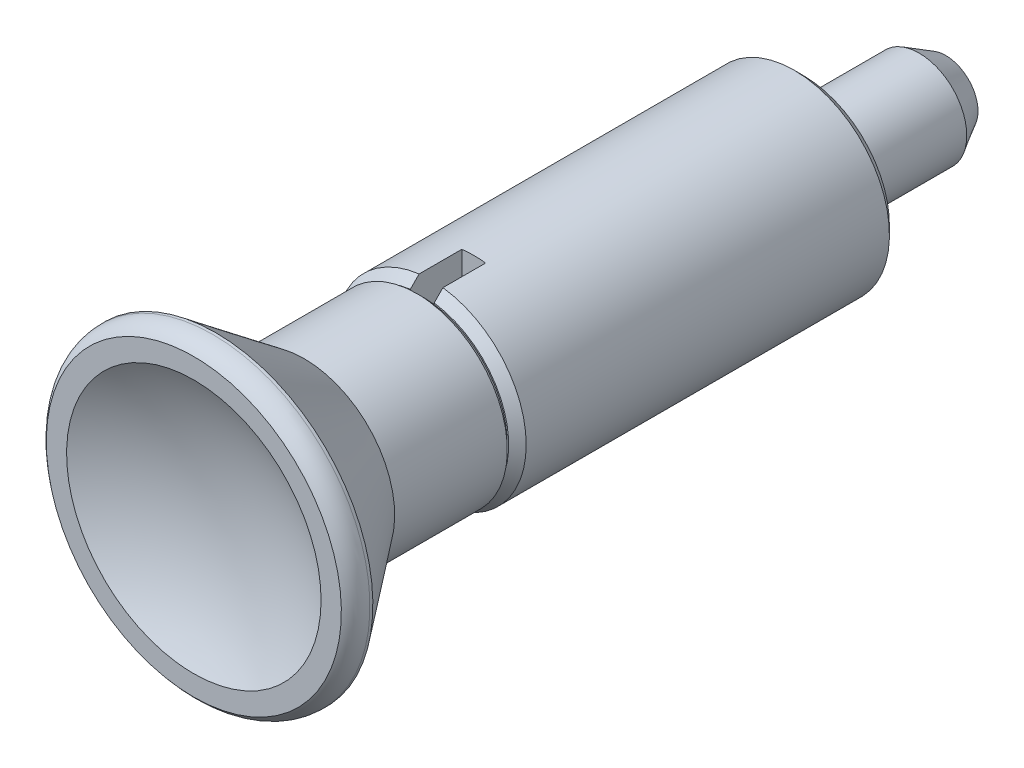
ISO-10303-21;
HEADER;
FILE_DESCRIPTION(('STEP AP214'),'2;1');
FILE_NAME('part.step','',(''),(''),'','','');
FILE_SCHEMA(('AUTOMOTIVE_DESIGN { 1 0 10303 214 1 1 1 1 }'));
ENDSEC;
DATA;
#1=APPLICATION_CONTEXT('core data for automotive mechanical design processes');
#2=APPLICATION_PROTOCOL_DEFINITION('international standard','automotive_design',2000,#1);
#3=PRODUCT_CONTEXT('',#1,'mechanical');
#4=PRODUCT('Part','Part','',(#3));
#5=PRODUCT_RELATED_PRODUCT_CATEGORY('part','',(#4));
#6=PRODUCT_DEFINITION_FORMATION('','',#4);
#7=PRODUCT_DEFINITION_CONTEXT('part definition',#1,'design');
#8=PRODUCT_DEFINITION('design','',#6,#7);
#9=PRODUCT_DEFINITION_SHAPE('','',#8);
#10=(LENGTH_UNIT() NAMED_UNIT(*) SI_UNIT(.MILLI.,.METRE.));
#11=(NAMED_UNIT(*) PLANE_ANGLE_UNIT() SI_UNIT($,.RADIAN.));
#12=(NAMED_UNIT(*) SI_UNIT($,.STERADIAN.) SOLID_ANGLE_UNIT());
#13=UNCERTAINTY_MEASURE_WITH_UNIT(LENGTH_MEASURE(1.E-05),#10,'distance_accuracy_value','');
#14=(GEOMETRIC_REPRESENTATION_CONTEXT(3) GLOBAL_UNCERTAINTY_ASSIGNED_CONTEXT((#13)) GLOBAL_UNIT_ASSIGNED_CONTEXT((#10,
#11,#12)) REPRESENTATION_CONTEXT('',''));
#15=CARTESIAN_POINT('',(0.,0.,0.));
#16=DIRECTION('',(0.,0.,1.));
#17=DIRECTION('',(1.,0.,0.));
#18=AXIS2_PLACEMENT_3D('',#15,#16,#17);
#19=CARTESIAN_POINT('',(1.25,19.,34.6));
#20=DIRECTION('',(0.,0.,1.));
#21=DIRECTION('',(0.,1.,0.));
#22=AXIS2_PLACEMENT_3D('',#19,#20,#21);
#23=PLANE('',#22);
#24=DIRECTION('',(0.,1.,0.));
#25=VECTOR('',#24,1.);
#26=CARTESIAN_POINT('',(-1.25,19.,34.6));
#27=LINE('',#26,#25);
#28=CARTESIAN_POINT('',(-1.25,-9.92156741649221,34.6));
#29=VERTEX_POINT('',#28);
#30=CARTESIAN_POINT('',(-1.25,-4.84122918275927,34.6));
#31=VERTEX_POINT('',#30);
#32=EDGE_CURVE('E152',#29,#31,#27,.T.);
#33=ORIENTED_EDGE('',*,*,#32,.F.);
#34=CARTESIAN_POINT('',(0.,0.,34.6));
#35=DIRECTION('',(0.,0.,1.));
#36=DIRECTION('',(0.,1.,0.));
#37=AXIS2_PLACEMENT_3D('',#34,#35,#36);
#38=CIRCLE('',#37,10.);
#39=CARTESIAN_POINT('',(1.25,-9.92156741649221,34.6));
#40=VERTEX_POINT('',#39);
#41=EDGE_CURVE('E113',#40,#29,#38,.F.);
#42=ORIENTED_EDGE('',*,*,#41,.F.);
#43=DIRECTION('',(0.,-1.,0.));
#44=VECTOR('',#43,1.);
#45=CARTESIAN_POINT('',(1.25,19.,34.6));
#46=LINE('',#45,#44);
#47=CARTESIAN_POINT('',(1.25,-4.84122918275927,34.6));
#48=VERTEX_POINT('',#47);
#49=EDGE_CURVE('E144',#48,#40,#46,.T.);
#50=ORIENTED_EDGE('',*,*,#49,.F.);
#51=CARTESIAN_POINT('',(0.,0.,34.6));
#52=DIRECTION('',(0.,0.,1.));
#53=DIRECTION('',(0.,1.,0.));
#54=AXIS2_PLACEMENT_3D('',#51,#52,#53);
#55=CIRCLE('',#54,5.);
#56=EDGE_CURVE('E139',#31,#48,#55,.T.);
#57=ORIENTED_EDGE('',*,*,#56,.F.);
#58=EDGE_LOOP('',(#33,#42,#50,#57));
#59=FACE_BOUND('',#58,.T.);
#60=ADVANCED_FACE('F14',(#59),#23,.T.);
#61=CARTESIAN_POINT('',(1.25,19.,34.6));
#62=DIRECTION('',(0.,0.,1.));
#63=DIRECTION('',(0.,1.,0.));
#64=AXIS2_PLACEMENT_3D('',#61,#62,#63);
#65=PLANE('',#64);
#66=DIRECTION('',(0.,-1.,0.));
#67=VECTOR('',#66,1.);
#68=CARTESIAN_POINT('',(1.25,19.,34.6));
#69=LINE('',#68,#67);
#70=CARTESIAN_POINT('',(1.25,9.92156741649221,34.6));
#71=VERTEX_POINT('',#70);
#72=CARTESIAN_POINT('',(1.25,4.84122918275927,34.6));
#73=VERTEX_POINT('',#72);
#74=EDGE_CURVE('E109',#71,#73,#69,.T.);
#75=ORIENTED_EDGE('',*,*,#74,.F.);
#76=CARTESIAN_POINT('',(0.,0.,34.6));
#77=DIRECTION('',(0.,0.,1.));
#78=DIRECTION('',(0.,1.,0.));
#79=AXIS2_PLACEMENT_3D('',#76,#77,#78);
#80=CIRCLE('',#79,10.);
#81=CARTESIAN_POINT('',(-1.25,9.92156741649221,34.6));
#82=VERTEX_POINT('',#81);
#83=EDGE_CURVE('E102',#82,#71,#80,.F.);
#84=ORIENTED_EDGE('',*,*,#83,.F.);
#85=DIRECTION('',(0.,1.,0.));
#86=VECTOR('',#85,1.);
#87=CARTESIAN_POINT('',(-1.25,19.,34.6));
#88=LINE('',#87,#86);
#89=CARTESIAN_POINT('',(-1.25,4.84122918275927,34.6));
#90=VERTEX_POINT('',#89);
#91=EDGE_CURVE('E106',#90,#82,#88,.T.);
#92=ORIENTED_EDGE('',*,*,#91,.F.);
#93=CARTESIAN_POINT('',(0.,0.,34.6));
#94=DIRECTION('',(0.,0.,1.));
#95=DIRECTION('',(0.,1.,0.));
#96=AXIS2_PLACEMENT_3D('',#93,#94,#95);
#97=CIRCLE('',#96,5.);
#98=EDGE_CURVE('E279',#73,#90,#97,.T.);
#99=ORIENTED_EDGE('',*,*,#98,.F.);
#100=EDGE_LOOP('',(#75,#84,#92,#99));
#101=FACE_BOUND('',#100,.T.);
#102=ADVANCED_FACE('F104',(#101),#65,.T.);
#103=CARTESIAN_POINT('',(0.,0.,0.));
#104=DIRECTION('',(0.,0.,1.));
#105=DIRECTION('',(0.,1.,0.));
#106=AXIS2_PLACEMENT_3D('',#103,#104,#105);
#107=CYLINDRICAL_SURFACE('',#106,10.);
#108=DIRECTION('',(0.,0.,1.));
#109=VECTOR('',#108,1.);
#110=CARTESIAN_POINT('',(1.25,-9.92156741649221,40.));
#111=LINE('',#110,#109);
#112=CARTESIAN_POINT('',(1.25,-9.92156741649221,39.08));
#113=VERTEX_POINT('',#112);
#114=EDGE_CURVE('E141',#40,#113,#111,.T.);
#115=ORIENTED_EDGE('',*,*,#114,.F.);
#116=ORIENTED_EDGE('',*,*,#41,.T.);
#117=DIRECTION('',(0.,0.,1.));
#118=VECTOR('',#117,1.);
#119=CARTESIAN_POINT('',(-1.25,-9.92156741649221,34.6));
#120=LINE('',#119,#118);
#121=CARTESIAN_POINT('',(-1.25,-9.92156741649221,39.08));
#122=VERTEX_POINT('',#121);
#123=EDGE_CURVE('E148',#122,#29,#120,.F.);
#124=ORIENTED_EDGE('',*,*,#123,.F.);
#125=CARTESIAN_POINT('',(0.,0.,39.08));
#126=DIRECTION('',(0.,0.,-1.));
#127=DIRECTION('',(0.,-1.,0.));
#128=AXIS2_PLACEMENT_3D('',#125,#126,#127);
#129=CIRCLE('',#128,10.);
#130=CARTESIAN_POINT('',(-1.25,9.92156741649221,39.08));
#131=VERTEX_POINT('',#130);
#132=EDGE_CURVE('E122',#131,#122,#129,.F.);
#133=ORIENTED_EDGE('',*,*,#132,.F.);
#134=DIRECTION('',(0.,0.,1.));
#135=VECTOR('',#134,1.);
#136=CARTESIAN_POINT('',(-1.25,9.92156741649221,34.6));
#137=LINE('',#136,#135);
#138=EDGE_CURVE('E117',#82,#131,#137,.T.);
#139=ORIENTED_EDGE('',*,*,#138,.F.);
#140=ORIENTED_EDGE('',*,*,#83,.T.);
#141=DIRECTION('',(0.,0.,1.));
#142=VECTOR('',#141,1.);
#143=CARTESIAN_POINT('',(1.25,9.92156741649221,40.));
#144=LINE('',#143,#142);
#145=CARTESIAN_POINT('',(1.25,9.92156741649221,39.08));
#146=VERTEX_POINT('',#145);
#147=EDGE_CURVE('E284',#146,#71,#144,.F.);
#148=ORIENTED_EDGE('',*,*,#147,.F.);
#149=CARTESIAN_POINT('',(0.,0.,39.08));
#150=DIRECTION('',(0.,0.,-1.));
#151=DIRECTION('',(0.,-1.,0.));
#152=AXIS2_PLACEMENT_3D('',#149,#150,#151);
#153=CIRCLE('',#152,10.);
#154=EDGE_CURVE('E132',#113,#146,#153,.F.);
#155=ORIENTED_EDGE('',*,*,#154,.F.);
#156=EDGE_LOOP('',(#115,#116,#124,#133,#139,#140,#148,#155));
#157=FACE_BOUND('',#156,.T.);
#158=CARTESIAN_POINT('',(0.,0.,0.92));
#159=DIRECTION('',(0.,0.,1.));
#160=DIRECTION('',(0.,1.,0.));
#161=AXIS2_PLACEMENT_3D('',#158,#159,#160);
#162=CIRCLE('',#161,10.);
#163=CARTESIAN_POINT('',(0.,10.,0.92));
#164=VERTEX_POINT('',#163);
#165=EDGE_CURVE('E114',#164,#164,#162,.T.);
#166=ORIENTED_EDGE('',*,*,#165,.T.);
#167=EDGE_LOOP('',(#166));
#168=FACE_BOUND('',#167,.T.);
#169=ADVANCED_FACE('F119',(#157,#168),#107,.T.);
#170=CARTESIAN_POINT('',(0.,0.,39.08));
#171=DIRECTION('',(0.,0.,-1.));
#172=DIRECTION('',(0.,-1.,0.));
#173=AXIS2_PLACEMENT_3D('',#170,#171,#172);
#174=CONICAL_SURFACE('',#173,10.,0.78539816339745);
#175=CARTESIAN_POINT('',(-1.25,9.92156741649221,39.08));
#176=CARTESIAN_POINT('',(-1.25,9.76696218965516,39.2333986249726));
#177=CARTESIAN_POINT('',(-1.25,9.61232459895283,39.3867646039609));
#178=CARTESIAN_POINT('',(-1.25,9.30298468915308,39.6934312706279));
#179=CARTESIAN_POINT('',(-1.25,9.14828237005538,39.8467319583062));
#180=CARTESIAN_POINT('',(-1.25,8.99354768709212,40.));
#181=B_SPLINE_CURVE_WITH_KNOTS('',3,(#175,#176,#177,#178,#179,#180),.UNSPECIFIED.,.F.,.F.,(4,2,
4),(0.,0.653379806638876,1.30675961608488),.UNSPECIFIED.);
#182=CARTESIAN_POINT('',(-1.25,8.99354768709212,40.));
#183=VERTEX_POINT('',#182);
#184=EDGE_CURVE('E126',#131,#183,#181,.T.);
#185=ORIENTED_EDGE('',*,*,#184,.F.);
#186=ORIENTED_EDGE('',*,*,#132,.T.);
#187=CARTESIAN_POINT('',(-1.25,-8.99354768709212,40.));
#188=CARTESIAN_POINT('',(-1.25,-9.14828237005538,39.8467319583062));
#189=CARTESIAN_POINT('',(-1.25,-9.30298468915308,39.6934312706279));
#190=CARTESIAN_POINT('',(-1.25,-9.61232459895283,39.3867646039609));
#191=CARTESIAN_POINT('',(-1.25,-9.76696218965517,39.2333986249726));
#192=CARTESIAN_POINT('',(-1.25,-9.92156741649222,39.08));
#193=B_SPLINE_CURVE_WITH_KNOTS('',3,(#187,#188,#189,#190,#191,#192),.UNSPECIFIED.,.F.,.F.,(4,2,
4),(0.,0.653379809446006,1.30675961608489),.UNSPECIFIED.);
#194=CARTESIAN_POINT('',(-1.25,-8.99354768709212,40.));
#195=VERTEX_POINT('',#194);
#196=EDGE_CURVE('E151',#195,#122,#193,.T.);
#197=ORIENTED_EDGE('',*,*,#196,.F.);
#198=CARTESIAN_POINT('',(0.,0.,40.));
#199=DIRECTION('',(0.,0.,-1.));
#200=DIRECTION('',(0.,-1.,0.));
#201=AXIS2_PLACEMENT_3D('',#198,#199,#200);
#202=CIRCLE('',#201,9.08);
#203=EDGE_CURVE('E272',#195,#183,#202,.T.);
#204=ORIENTED_EDGE('',*,*,#203,.T.);
#205=EDGE_LOOP('',(#185,#186,#197,#204));
#206=FACE_BOUND('',#205,.T.);
#207=ADVANCED_FACE('F331',(#206),#174,.T.);
#208=CARTESIAN_POINT('',(0.,0.,-15.));
#209=DIRECTION('',(0.,0.,1.));
#210=DIRECTION('',(0.,1.,0.));
#211=AXIS2_PLACEMENT_3D('',#208,#209,#210);
#212=CYLINDRICAL_SURFACE('',#211,5.);
#213=DIRECTION('',(0.,0.,1.));
#214=VECTOR('',#213,1.);
#215=CARTESIAN_POINT('',(-1.25,-4.84122918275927,34.6));
#216=LINE('',#215,#214);
#217=CARTESIAN_POINT('',(-1.25,-4.84122918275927,40.));
#218=VERTEX_POINT('',#217);
#219=EDGE_CURVE('E155',#31,#218,#216,.T.);
#220=ORIENTED_EDGE('',*,*,#219,.F.);
#221=ORIENTED_EDGE('',*,*,#56,.T.);
#222=DIRECTION('',(0.,0.,1.));
#223=VECTOR('',#222,1.);
#224=CARTESIAN_POINT('',(1.25,-4.84122918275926,40.));
#225=LINE('',#224,#223);
#226=CARTESIAN_POINT('',(1.25,-4.84122918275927,40.));
#227=VERTEX_POINT('',#226);
#228=EDGE_CURVE('E147',#227,#48,#225,.F.);
#229=ORIENTED_EDGE('',*,*,#228,.F.);
#230=CARTESIAN_POINT('',(0.,0.,40.));
#231=DIRECTION('',(0.,0.,1.));
#232=DIRECTION('',(0.,1.,0.));
#233=AXIS2_PLACEMENT_3D('',#230,#231,#232);
#234=CIRCLE('',#233,5.);
#235=EDGE_CURVE('E267',#227,#218,#234,.F.);
#236=ORIENTED_EDGE('',*,*,#235,.T.);
#237=EDGE_LOOP('',(#220,#221,#229,#236));
#238=FACE_BOUND('',#237,.T.);
#239=ADVANCED_FACE('F335',(#238),#212,.T.);
#240=CARTESIAN_POINT('',(-1.25,19.,34.6));
#241=DIRECTION('',(1.,0.,0.));
#242=DIRECTION('',(0.,1.,0.));
#243=AXIS2_PLACEMENT_3D('',#240,#241,#242);
#244=PLANE('',#243);
#245=ORIENTED_EDGE('',*,*,#196,.T.);
#246=ORIENTED_EDGE('',*,*,#123,.T.);
#247=ORIENTED_EDGE('',*,*,#32,.T.);
#248=ORIENTED_EDGE('',*,*,#219,.T.);
#249=DIRECTION('',(0.,1.,0.));
#250=VECTOR('',#249,1.);
#251=CARTESIAN_POINT('',(-1.25,0.,40.));
#252=LINE('',#251,#250);
#253=CARTESIAN_POINT('',(-1.25,-8.84643865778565,40.));
#254=VERTEX_POINT('',#253);
#255=EDGE_CURVE('E265',#218,#254,#252,.F.);
#256=ORIENTED_EDGE('',*,*,#255,.T.);
#257=DIRECTION('',(0.,-1.,0.));
#258=VECTOR('',#257,1.);
#259=CARTESIAN_POINT('',(-1.25,0.,40.));
#260=LINE('',#259,#258);
#261=EDGE_CURVE('E268',#254,#195,#260,.T.);
#262=ORIENTED_EDGE('',*,*,#261,.T.);
#263=EDGE_LOOP('',(#245,#246,#247,#248,#256,#262));
#264=FACE_BOUND('',#263,.T.);
#265=ADVANCED_FACE('F328',(#264),#244,.T.);
#266=CARTESIAN_POINT('',(1.25,19.,40.));
#267=DIRECTION('',(-1.,0.,0.));
#268=DIRECTION('',(0.,-1.,0.));
#269=AXIS2_PLACEMENT_3D('',#266,#267,#268);
#270=PLANE('',#269);
#271=CARTESIAN_POINT('',(1.25,-8.99354768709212,40.));
#272=CARTESIAN_POINT('',(1.25,-9.14828237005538,39.8467319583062));
#273=CARTESIAN_POINT('',(1.25,-9.30298468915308,39.6934312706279));
#274=CARTESIAN_POINT('',(1.25,-9.61232459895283,39.3867646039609));
#275=CARTESIAN_POINT('',(1.25,-9.76696218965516,39.2333986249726));
#276=CARTESIAN_POINT('',(1.25,-9.92156741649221,39.08));
#277=B_SPLINE_CURVE_WITH_KNOTS('',3,(#271,#272,#273,#274,#275,#276),.UNSPECIFIED.,.F.,.F.,(4,2,
4),(0.,0.653379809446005,1.30675961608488),.UNSPECIFIED.);
#278=CARTESIAN_POINT('',(1.25,-8.99354768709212,40.));
#279=VERTEX_POINT('',#278);
#280=EDGE_CURVE('E134',#279,#113,#277,.T.);
#281=ORIENTED_EDGE('',*,*,#280,.F.);
#282=DIRECTION('',(0.,-1.,0.));
#283=VECTOR('',#282,1.);
#284=CARTESIAN_POINT('',(1.25,19.,40.));
#285=LINE('',#284,#283);
#286=CARTESIAN_POINT('',(1.25,-8.84643865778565,40.));
#287=VERTEX_POINT('',#286);
#288=EDGE_CURVE('E143',#279,#287,#285,.F.);
#289=ORIENTED_EDGE('',*,*,#288,.T.);
#290=DIRECTION('',(0.,1.,0.));
#291=VECTOR('',#290,1.);
#292=CARTESIAN_POINT('',(1.25,0.,40.));
#293=LINE('',#292,#291);
#294=EDGE_CURVE('E262',#287,#227,#293,.T.);
#295=ORIENTED_EDGE('',*,*,#294,.T.);
#296=ORIENTED_EDGE('',*,*,#228,.T.);
#297=ORIENTED_EDGE('',*,*,#49,.T.);
#298=ORIENTED_EDGE('',*,*,#114,.T.);
#299=EDGE_LOOP('',(#281,#289,#295,#296,#297,#298));
#300=FACE_BOUND('',#299,.T.);
#301=ADVANCED_FACE('F303',(#300),#270,.T.);
#302=CARTESIAN_POINT('',(0.,0.,39.08));
#303=DIRECTION('',(0.,0.,-1.));
#304=DIRECTION('',(0.,-1.,0.));
#305=AXIS2_PLACEMENT_3D('',#302,#303,#304);
#306=CONICAL_SURFACE('',#305,10.,0.78539816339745);
#307=CARTESIAN_POINT('',(1.25,8.99354768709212,40.));
#308=CARTESIAN_POINT('',(1.25,9.14828237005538,39.8467319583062));
#309=CARTESIAN_POINT('',(1.25,9.30298468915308,39.6934312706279));
#310=CARTESIAN_POINT('',(1.25,9.61232459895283,39.3867646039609));
#311=CARTESIAN_POINT('',(1.25,9.76696218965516,39.2333986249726));
#312=CARTESIAN_POINT('',(1.25,9.92156741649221,39.08));
#313=B_SPLINE_CURVE_WITH_KNOTS('',3,(#307,#308,#309,#310,#311,#312),.UNSPECIFIED.,.F.,.F.,(4,2,
4),(0.,0.653379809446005,1.30675961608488),.UNSPECIFIED.);
#314=CARTESIAN_POINT('',(1.25,8.99354768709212,40.));
#315=VERTEX_POINT('',#314);
#316=EDGE_CURVE('E277',#315,#146,#313,.T.);
#317=ORIENTED_EDGE('',*,*,#316,.F.);
#318=CARTESIAN_POINT('',(0.,0.,40.));
#319=DIRECTION('',(0.,0.,-1.));
#320=DIRECTION('',(0.,-1.,0.));
#321=AXIS2_PLACEMENT_3D('',#318,#319,#320);
#322=CIRCLE('',#321,9.08);
#323=EDGE_CURVE('E259',#315,#279,#322,.T.);
#324=ORIENTED_EDGE('',*,*,#323,.T.);
#325=ORIENTED_EDGE('',*,*,#280,.T.);
#326=ORIENTED_EDGE('',*,*,#154,.T.);
#327=EDGE_LOOP('',(#317,#324,#325,#326));
#328=FACE_BOUND('',#327,.T.);
#329=ADVANCED_FACE('F298',(#328),#306,.T.);
#330=CARTESIAN_POINT('',(-1.25,19.,34.6));
#331=DIRECTION('',(1.,0.,0.));
#332=DIRECTION('',(0.,1.,0.));
#333=AXIS2_PLACEMENT_3D('',#330,#331,#332);
#334=PLANE('',#333);
#335=ORIENTED_EDGE('',*,*,#184,.T.);
#336=DIRECTION('',(0.,-1.,0.));
#337=VECTOR('',#336,1.);
#338=CARTESIAN_POINT('',(-1.25,0.,40.));
#339=LINE('',#338,#337);
#340=CARTESIAN_POINT('',(-1.25,8.84643865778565,40.));
#341=VERTEX_POINT('',#340);
#342=EDGE_CURVE('E271',#183,#341,#339,.T.);
#343=ORIENTED_EDGE('',*,*,#342,.T.);
#344=DIRECTION('',(0.,1.,0.));
#345=VECTOR('',#344,1.);
#346=CARTESIAN_POINT('',(-1.25,0.,40.));
#347=LINE('',#346,#345);
#348=CARTESIAN_POINT('',(-1.25,4.84122918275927,40.));
#349=VERTEX_POINT('',#348);
#350=EDGE_CURVE('E257',#341,#349,#347,.F.);
#351=ORIENTED_EDGE('',*,*,#350,.T.);
#352=DIRECTION('',(0.,0.,1.));
#353=VECTOR('',#352,1.);
#354=CARTESIAN_POINT('',(-1.25,4.84122918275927,-15.));
#355=LINE('',#354,#353);
#356=EDGE_CURVE('E130',#90,#349,#355,.T.);
#357=ORIENTED_EDGE('',*,*,#356,.F.);
#358=ORIENTED_EDGE('',*,*,#91,.T.);
#359=ORIENTED_EDGE('',*,*,#138,.T.);
#360=EDGE_LOOP('',(#335,#343,#351,#357,#358,#359));
#361=FACE_BOUND('',#360,.T.);
#362=ADVANCED_FACE('F128',(#361),#334,.T.);
#363=CARTESIAN_POINT('',(0.,0.,-15.));
#364=DIRECTION('',(0.,0.,1.));
#365=DIRECTION('',(0.,1.,0.));
#366=AXIS2_PLACEMENT_3D('',#363,#364,#365);
#367=CYLINDRICAL_SURFACE('',#366,5.);
#368=ORIENTED_EDGE('',*,*,#356,.T.);
#369=CARTESIAN_POINT('',(0.,0.,40.));
#370=DIRECTION('',(0.,0.,1.));
#371=DIRECTION('',(0.,1.,0.));
#372=AXIS2_PLACEMENT_3D('',#369,#370,#371);
#373=CIRCLE('',#372,5.);
#374=CARTESIAN_POINT('',(1.25,4.84122918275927,40.));
#375=VERTEX_POINT('',#374);
#376=EDGE_CURVE('E191',#349,#375,#373,.F.);
#377=ORIENTED_EDGE('',*,*,#376,.T.);
#378=DIRECTION('',(0.,0.,1.));
#379=VECTOR('',#378,1.);
#380=CARTESIAN_POINT('',(1.25,4.84122918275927,40.));
#381=LINE('',#380,#379);
#382=EDGE_CURVE('E275',#73,#375,#381,.T.);
#383=ORIENTED_EDGE('',*,*,#382,.F.);
#384=ORIENTED_EDGE('',*,*,#98,.T.);
#385=EDGE_LOOP('',(#368,#377,#383,#384));
#386=FACE_BOUND('',#385,.T.);
#387=ADVANCED_FACE('F499',(#386),#367,.T.);
#388=CARTESIAN_POINT('',(1.25,19.,40.));
#389=DIRECTION('',(-1.,0.,0.));
#390=DIRECTION('',(0.,-1.,0.));
#391=AXIS2_PLACEMENT_3D('',#388,#389,#390);
#392=PLANE('',#391);
#393=ORIENTED_EDGE('',*,*,#316,.T.);
#394=ORIENTED_EDGE('',*,*,#147,.T.);
#395=ORIENTED_EDGE('',*,*,#74,.T.);
#396=ORIENTED_EDGE('',*,*,#382,.T.);
#397=DIRECTION('',(0.,1.,0.));
#398=VECTOR('',#397,1.);
#399=CARTESIAN_POINT('',(1.25,0.,40.));
#400=LINE('',#399,#398);
#401=CARTESIAN_POINT('',(1.25,8.84643865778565,40.));
#402=VERTEX_POINT('',#401);
#403=EDGE_CURVE('E33',#375,#402,#400,.T.);
#404=ORIENTED_EDGE('',*,*,#403,.T.);
#405=DIRECTION('',(0.,-1.,0.));
#406=VECTOR('',#405,1.);
#407=CARTESIAN_POINT('',(1.25,0.,40.));
#408=LINE('',#407,#406);
#409=EDGE_CURVE('E260',#402,#315,#408,.F.);
#410=ORIENTED_EDGE('',*,*,#409,.T.);
#411=EDGE_LOOP('',(#393,#394,#395,#396,#404,#410));
#412=FACE_BOUND('',#411,.T.);
#413=ADVANCED_FACE('F225',(#412),#392,.T.);
#414=CARTESIAN_POINT('',(0.,0.,86.3));
#415=DIRECTION('',(1.,0.,0.));
#416=DIRECTION('',(0.,-1.,0.));
#417=AXIS2_PLACEMENT_3D('',#414,#415,#416);
#418=SPHERICAL_SURFACE('',#417,26.);
#419=CARTESIAN_POINT('',(0.,-13.36824595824,64.));
#420=CARTESIAN_POINT('',(0.375585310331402,-13.3682486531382,64.));
#421=CARTESIAN_POINT('',(0.751126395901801,-13.3524111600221,64.));
#422=CARTESIAN_POINT('',(1.49966463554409,-13.2891717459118,64.));
#423=CARTESIAN_POINT('',(1.87266109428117,-13.2417615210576,64.));
#424=CARTESIAN_POINT('',(2.61372997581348,-13.1156339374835,64.));
#425=CARTESIAN_POINT('',(2.98179666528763,-13.036882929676,64.));
#426=CARTESIAN_POINT('',(3.70998226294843,-12.848636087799,64.));
#427=CARTESIAN_POINT('',(4.07010119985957,-12.7391403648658,64.));
#428=CARTESIAN_POINT('',(4.7796552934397,-12.490243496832,64.));
#429=CARTESIAN_POINT('',(5.12909553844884,-12.3508568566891,64.));
#430=CARTESIAN_POINT('',(5.81499557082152,-12.0431356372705,64.));
#431=CARTESIAN_POINT('',(6.15145515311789,-11.8748006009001,64.));
#432=CARTESIAN_POINT('',(6.80891126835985,-11.5104276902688,64.));
#433=CARTESIAN_POINT('',(7.12991172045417,-11.3143968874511,64.));
#434=CARTESIAN_POINT('',(7.75425858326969,-10.8959942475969,64.));
#435=CARTESIAN_POINT('',(8.05760506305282,-10.6736225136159,64.));
#436=CARTESIAN_POINT('',(8.64452045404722,-10.2040929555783,64.));
#437=CARTESIAN_POINT('',(8.92808725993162,-9.95693249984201,64.));
#438=CARTESIAN_POINT('',(9.47339223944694,-9.43960204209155,64.));
#439=CARTESIAN_POINT('',(9.73513039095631,-9.1694320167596,64.));
#440=CARTESIAN_POINT('',(10.2349267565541,-8.60799236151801,64.));
#441=CARTESIAN_POINT('',(10.472984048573,-8.31672191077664,64.));
#442=CARTESIAN_POINT('',(10.9237145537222,-7.71516160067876,64.));
#443=CARTESIAN_POINT('',(11.1363877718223,-7.40487174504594,64.));
#444=CARTESIAN_POINT('',(11.5348344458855,-6.76748455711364,64.));
#445=CARTESIAN_POINT('',(11.7206084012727,-6.44038753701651,64.));
#446=CARTESIAN_POINT('',(12.0639405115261,-5.77170618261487,64.));
#447=CARTESIAN_POINT('',(12.2214986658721,-5.43012184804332,64.));
#448=CARTESIAN_POINT('',(12.507278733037,-4.73489504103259,64.));
#449=CARTESIAN_POINT('',(12.6355007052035,-4.38125259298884,64.));
#450=CARTESIAN_POINT('',(12.8616972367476,-3.66442308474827,64.));
#451=CARTESIAN_POINT('',(12.95967179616,-3.30123602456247,64.));
#452=CARTESIAN_POINT('',(13.1246771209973,-2.56789862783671,64.));
#453=CARTESIAN_POINT('',(13.1917078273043,-2.1977482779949,64.));
#454=CARTESIAN_POINT('',(13.2943486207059,-1.45311652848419,64.));
#455=CARTESIAN_POINT('',(13.3299587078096,-1.07863512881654,64.));
#456=CARTESIAN_POINT('',(13.3695050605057,-0.328004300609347,64.));
#457=CARTESIAN_POINT('',(13.373441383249,0.0481451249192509,64.));
#458=CARTESIAN_POINT('',(13.3496123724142,0.799438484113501,64.));
#459=CARTESIAN_POINT('',(13.3218470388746,1.17458241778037,64.));
#460=CARTESIAN_POINT('',(13.2348120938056,1.92119788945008,64.));
#461=CARTESIAN_POINT('',(13.1755424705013,2.29266942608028,64.));
#462=CARTESIAN_POINT('',(13.0259203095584,3.02929902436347,64.));
#463=CARTESIAN_POINT('',(12.9355677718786,3.3944570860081,64.));
#464=CARTESIAN_POINT('',(12.7244220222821,4.11586406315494,64.));
#465=CARTESIAN_POINT('',(12.6036287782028,4.47211296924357,64.));
#466=CARTESIAN_POINT('',(12.3324604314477,5.17316851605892,64.));
#467=CARTESIAN_POINT('',(12.1820853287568,5.51797515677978,64.));
#468=CARTESIAN_POINT('',(11.8528223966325,6.1936946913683,64.));
#469=CARTESIAN_POINT('',(11.6739345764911,6.52460758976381,64.));
#470=CARTESIAN_POINT('',(11.2889179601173,7.17018716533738,64.));
#471=CARTESIAN_POINT('',(11.0827891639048,7.48485384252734,64.));
#472=CARTESIAN_POINT('',(10.644756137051,8.09570375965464,64.));
#473=CARTESIAN_POINT('',(10.4128519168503,8.39188700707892,64.));
#474=CARTESIAN_POINT('',(9.92491667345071,8.96366451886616,64.));
#475=CARTESIAN_POINT('',(9.66888565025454,9.23925878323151,64.));
#476=CARTESIAN_POINT('',(9.13451699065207,9.76789905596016,64.));
#477=CARTESIAN_POINT('',(8.85617935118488,10.0209450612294,64.));
#478=CARTESIAN_POINT('',(8.27917630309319,10.5026897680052,64.));
#479=CARTESIAN_POINT('',(7.98051089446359,10.7313884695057,64.));
#480=CARTESIAN_POINT('',(7.36497559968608,11.1628126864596,64.));
#481=CARTESIAN_POINT('',(7.04810571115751,11.3655381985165,64.));
#482=CARTESIAN_POINT('',(6.3984142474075,11.7435747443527,64.));
#483=CARTESIAN_POINT('',(6.06559267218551,11.9188857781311,64.));
#484=CARTESIAN_POINT('',(5.3863640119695,12.2408470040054,64.));
#485=CARTESIAN_POINT('',(5.03995692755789,12.3874971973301,64.));
#486=CARTESIAN_POINT('',(4.33601998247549,12.6510941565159,64.));
#487=CARTESIAN_POINT('',(3.97849012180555,12.7680409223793,64.));
#488=CARTESIAN_POINT('',(3.25484946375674,12.9713996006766,64.));
#489=CARTESIAN_POINT('',(2.88873866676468,13.057811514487,64.));
#490=CARTESIAN_POINT('',(2.15053894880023,13.1994861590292,64.));
#491=CARTESIAN_POINT('',(1.778450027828,13.2547488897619,64.));
#492=CARTESIAN_POINT('',(1.0309393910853,13.3337322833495,64.));
#493=CARTESIAN_POINT('',(0.655517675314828,13.3574529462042,64.));
#494=CARTESIAN_POINT('',(-0.0959895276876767,13.3731835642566,64.));
#495=CARTESIAN_POINT('',(-0.472075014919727,13.3651935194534,64.));
#496=CARTESIAN_POINT('',(-1.22223603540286,13.3175595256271,64.));
#497=CARTESIAN_POINT('',(-1.59631156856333,13.277915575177,64.));
#498=CARTESIAN_POINT('',(-2.33979321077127,13.1672556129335,64.));
#499=CARTESIAN_POINT('',(-2.70919931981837,13.0962396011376,64.));
#500=CARTESIAN_POINT('',(-3.44071587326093,12.9233403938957,64.));
#501=CARTESIAN_POINT('',(-3.80282631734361,12.8214571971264,64.));
#502=CARTESIAN_POINT('',(-4.5171771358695,12.5875479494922,64.));
#503=CARTESIAN_POINT('',(-4.86941751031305,12.4555218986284,64.));
#504=CARTESIAN_POINT('',(-5.56152392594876,12.1622655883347,64.));
#505=CARTESIAN_POINT('',(-5.90138996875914,12.001035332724,64.));
#506=CARTESIAN_POINT('',(-6.56633152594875,11.650516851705,64.));
#507=CARTESIAN_POINT('',(-6.8914070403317,11.4612286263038,64.));
#508=CARTESIAN_POINT('',(-7.52445640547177,11.0559399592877,64.));
#509=CARTESIAN_POINT('',(-7.83243025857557,10.8399395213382,64.));
#510=CARTESIAN_POINT('',(-8.42908684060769,10.3827620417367,64.));
#511=CARTESIAN_POINT('',(-8.71776956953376,10.1415850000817,64.));
#512=CARTESIAN_POINT('',(-9.2737916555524,9.6357688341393,64.));
#513=CARTESIAN_POINT('',(-9.54113100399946,9.37112970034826,64.));
#514=CARTESIAN_POINT('',(-10.0525655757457,8.82027085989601,64.));
#515=CARTESIAN_POINT('',(-10.2966607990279,8.53405115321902,64.));
#516=CARTESIAN_POINT('',(-10.7598718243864,7.94206592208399,64.));
#517=CARTESIAN_POINT('',(-10.9789876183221,7.63630039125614,64.));
#518=CARTESIAN_POINT('',(-11.3906819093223,7.00739740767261,64.));
#519=CARTESIAN_POINT('',(-11.5832604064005,6.68425995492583,64.));
#520=CARTESIAN_POINT('',(-11.9405107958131,6.02291079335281,64.));
#521=CARTESIAN_POINT('',(-12.1051827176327,5.684699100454,64.));
#522=CARTESIAN_POINT('',(-12.405449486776,4.99560562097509,64.));
#523=CARTESIAN_POINT('',(-12.5410443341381,4.64472383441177,64.));
#524=CARTESIAN_POINT('',(-12.7821929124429,3.93278485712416,64.));
#525=CARTESIAN_POINT('',(-12.8877466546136,3.57172767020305,64.));
#526=CARTESIAN_POINT('',(-13.0680626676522,2.84200466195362,64.));
#527=CARTESIAN_POINT('',(-13.1428249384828,2.47333884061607,64.));
#528=CARTESIAN_POINT('',(-13.2610266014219,1.73101888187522,64.));
#529=CARTESIAN_POINT('',(-13.3044659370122,1.35736473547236,64.));
#530=CARTESIAN_POINT('',(-13.3597126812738,0.607725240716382,64.));
#531=CARTESIAN_POINT('',(-13.371520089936,0.231739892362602,64.));
#532=CARTESIAN_POINT('',(-13.3634190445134,-0.519888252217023,64.));
#533=CARTESIAN_POINT('',(-13.3435106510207,-0.895531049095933,64.));
#534=CARTESIAN_POINT('',(-13.2721196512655,-1.64380422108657,64.));
#535=CARTESIAN_POINT('',(-13.2206370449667,-2.01643459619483,64.));
#536=CARTESIAN_POINT('',(-13.0864634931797,-2.75603450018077,64.));
#537=CARTESIAN_POINT('',(-13.0037724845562,-3.12300401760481,64.));
#538=CARTESIAN_POINT('',(-12.8077700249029,-3.84867248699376,64.));
#539=CARTESIAN_POINT('',(-12.6944585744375,-4.20737143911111,64.));
#540=CARTESIAN_POINT('',(-12.4380184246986,-4.91395521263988,64.));
#541=CARTESIAN_POINT('',(-12.2948891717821,-5.26183983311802,64.));
#542=CARTESIAN_POINT('',(-11.9798322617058,-5.94431469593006,64.));
#543=CARTESIAN_POINT('',(-11.8079045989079,-6.27890493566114,64.));
#544=CARTESIAN_POINT('',(-11.4364804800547,-6.93239940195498,64.));
#545=CARTESIAN_POINT('',(-11.2369850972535,-7.2513042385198,64.));
#546=CARTESIAN_POINT('',(-10.8118388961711,-7.87117441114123,64.));
#547=CARTESIAN_POINT('',(-10.5861881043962,-8.1721397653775,64.));
#548=CARTESIAN_POINT('',(-10.1103604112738,-8.75396077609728,64.));
#549=CARTESIAN_POINT('',(-9.86018611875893,-9.03481856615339,64.));
#550=CARTESIAN_POINT('',(-9.33706848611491,-9.5744644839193,64.));
#551=CARTESIAN_POINT('',(-9.06412505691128,-9.83325252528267,64.));
#552=CARTESIAN_POINT('',(-8.49733759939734,-10.3269813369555,64.));
#553=CARTESIAN_POINT('',(-8.20348826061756,-10.5619160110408,64.));
#554=CARTESIAN_POINT('',(-7.59704532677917,-11.0061886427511,64.));
#555=CARTESIAN_POINT('',(-7.28445202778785,-11.21552700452,64.));
#556=CARTESIAN_POINT('',(-6.64258363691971,-11.6072177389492,64.));
#557=CARTESIAN_POINT('',(-6.31330053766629,-11.7895569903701,64.));
#558=CARTESIAN_POINT('',(-5.64053678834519,-12.1258308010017,64.));
#559=CARTESIAN_POINT('',(-5.2970560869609,-12.2797652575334,64.));
#560=CARTESIAN_POINT('',(-4.59871120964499,-12.5579840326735,64.));
#561=CARTESIAN_POINT('',(-4.24385967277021,-12.6823000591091,64.));
#562=CARTESIAN_POINT('',(-3.52506734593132,-12.9005804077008,64.));
#563=CARTESIAN_POINT('',(-3.16112897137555,-12.9945527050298,64.));
#564=CARTESIAN_POINT('',(-2.33514245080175,-13.1710678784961,64.));
#565=CARTESIAN_POINT('',(-1.87121744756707,-13.2449469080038,64.));
#566=CARTESIAN_POINT('',(-0.93817197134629,-13.3435342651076,64.));
#567=CARTESIAN_POINT('',(-0.469051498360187,-13.3682425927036,64.));
#568=CARTESIAN_POINT('',(0.,-13.36824595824,64.));
#569=B_SPLINE_CURVE_WITH_KNOTS('',3,(#419,#420,#421,#422,#423,#424,#425,#426,#427,#428,#429,
#430,#431,#432,#433,#434,#435,#436,#437,#438,#439,#440,#441,#442,#443,#444,#445,#446,#447,#448,
#449,#450,#451,#452,#453,#454,#455,#456,#457,#458,#459,#460,#461,#462,#463,#464,#465,#466,#467,
#468,#469,#470,#471,#472,#473,#474,#475,#476,#477,#478,#479,#480,#481,#482,#483,#484,#485,#486,
#487,#488,#489,#490,#491,#492,#493,#494,#495,#496,#497,#498,#499,#500,#501,#502,#503,#504,#505,
#506,#507,#508,#509,#510,#511,#512,#513,#514,#515,#516,#517,#518,#519,#520,#521,#522,#523,#524,
#525,#526,#527,#528,#529,#530,#531,#532,#533,#534,#535,#536,#537,#538,#539,#540,#541,#542,#543,
#544,#545,#546,#547,#548,#549,#550,#551,#552,#553,#554,#555,#556,#557,#558,#559,#560,#561,#562,
#563,#564,#565,#566,#567,#568),.UNSPECIFIED.,.T.,.F.,(4,2,2,2,2,2,2,2,2,2,2,2,2,2,2,2,2,2,2,2,2,
2,2,2,2,2,2,2,2,2,2,2,2,2,2,2,2,2,2,2,2,2,2,2,2,2,2,2,2,2,2,2,2,2,2,2,2,2,2,2,2,2,2,2,2,2,2,2,2,
2,2,2,2,2,4),(0.,1.12634621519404,2.25298878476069,3.38084425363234,4.50869564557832,
5.63600096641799,6.76332408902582,7.89035989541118,9.01739129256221,10.1445424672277,
11.2716947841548,12.3988909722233,13.5260869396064,14.6532619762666,15.7804370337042,
16.9076098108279,18.034782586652,19.1619575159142,20.2891324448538,21.4163053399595,
22.5434782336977,23.6706515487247,24.7978248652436,25.9249993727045,27.0521738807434,
28.1793480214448,29.306522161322,30.4336958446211,31.560869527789,32.6880433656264,
33.8152172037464,34.9423911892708,36.0695651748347,37.1967391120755,38.3239130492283,
39.4510869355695,40.5782608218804,41.7054347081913,42.8326085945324,43.9597825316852,
45.086956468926,46.21413045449,47.3413044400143,48.4684782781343,49.5956521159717,
50.7228257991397,51.8499994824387,52.9771736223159,54.1043477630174,55.2315222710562,
56.3586967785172,57.485870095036,58.613043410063,59.7402163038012,60.867389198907,
61.9945641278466,63.1217390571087,64.2489118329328,65.3760846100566,66.5032596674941,
67.6304347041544,68.7576306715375,69.8848268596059,71.0119791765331,72.1391303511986,
73.2661617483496,74.3931975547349,75.5205206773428,76.6478259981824,77.7756773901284,
78.9035328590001,80.0301754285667,81.1565216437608,82.5631644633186,83.9698072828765),.UNSPECIFIED.);
#570=CARTESIAN_POINT('',(0.,-13.36824595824,64.));
#571=VERTEX_POINT('',#570);
#572=EDGE_CURVE('E183',#571,#571,#569,.T.);
#573=ORIENTED_EDGE('',*,*,#572,.T.);
#574=EDGE_LOOP('',(#573));
#575=FACE_BOUND('',#574,.T.);
#576=ADVANCED_FACE('F193',(#575),#418,.F.);
#577=CARTESIAN_POINT('',(0.,0.,40.));
#578=DIRECTION('',(0.,0.,-1.));
#579=DIRECTION('',(0.,-1.,0.));
#580=AXIS2_PLACEMENT_3D('',#577,#578,#579);
#581=PLANE('',#580);
#582=CARTESIAN_POINT('',(0.,0.,40.));
#583=DIRECTION('',(0.,0.,1.));
#584=DIRECTION('',(1.,0.,0.));
#585=AXIS2_PLACEMENT_3D('',#582,#583,#584);
#586=CIRCLE('',#585,8.93431457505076);
#587=EDGE_CURVE('E180',#341,#254,#586,.T.);
#588=ORIENTED_EDGE('',*,*,#587,.F.);
#589=ORIENTED_EDGE('',*,*,#342,.F.);
#590=ORIENTED_EDGE('',*,*,#203,.F.);
#591=ORIENTED_EDGE('',*,*,#261,.F.);
#592=EDGE_LOOP('',(#588,#589,#590,#591));
#593=FACE_BOUND('',#592,.T.);
#594=ADVANCED_FACE('F216',(#593),#581,.F.);
#595=CARTESIAN_POINT('',(-8.93431457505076,0.,40.));
#596=DIRECTION('',(0.,0.,1.));
#597=DIRECTION('',(0.,1.,0.));
#598=AXIS2_PLACEMENT_3D('',#595,#596,#597);
#599=PLANE('',#598);
#600=CARTESIAN_POINT('',(0.,0.,40.));
#601=DIRECTION('',(0.,0.,1.));
#602=DIRECTION('',(1.,0.,0.));
#603=AXIS2_PLACEMENT_3D('',#600,#601,#602);
#604=CIRCLE('',#603,8.93431457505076);
#605=EDGE_CURVE('E177',#254,#287,#604,.T.);
#606=ORIENTED_EDGE('',*,*,#605,.F.);
#607=ORIENTED_EDGE('',*,*,#255,.F.);
#608=ORIENTED_EDGE('',*,*,#235,.F.);
#609=ORIENTED_EDGE('',*,*,#294,.F.);
#610=EDGE_LOOP('',(#606,#607,#608,#609));
#611=FACE_BOUND('',#610,.T.);
#612=ADVANCED_FACE('F213',(#611),#599,.F.);
#613=CARTESIAN_POINT('',(0.,0.,40.));
#614=DIRECTION('',(0.,0.,-1.));
#615=DIRECTION('',(0.,-1.,0.));
#616=AXIS2_PLACEMENT_3D('',#613,#614,#615);
#617=PLANE('',#616);
#618=ORIENTED_EDGE('',*,*,#288,.F.);
#619=ORIENTED_EDGE('',*,*,#323,.F.);
#620=ORIENTED_EDGE('',*,*,#409,.F.);
#621=CARTESIAN_POINT('',(0.,0.,40.));
#622=DIRECTION('',(0.,0.,1.));
#623=DIRECTION('',(1.,0.,0.));
#624=AXIS2_PLACEMENT_3D('',#621,#622,#623);
#625=CIRCLE('',#624,8.93431457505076);
#626=EDGE_CURVE('E174',#287,#402,#625,.T.);
#627=ORIENTED_EDGE('',*,*,#626,.F.);
#628=EDGE_LOOP('',(#618,#619,#620,#627));
#629=FACE_BOUND('',#628,.T.);
#630=ADVANCED_FACE('F209',(#629),#617,.F.);
#631=CARTESIAN_POINT('',(-8.93431457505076,0.,40.));
#632=DIRECTION('',(0.,0.,1.));
#633=DIRECTION('',(0.,1.,0.));
#634=AXIS2_PLACEMENT_3D('',#631,#632,#633);
#635=PLANE('',#634);
#636=ORIENTED_EDGE('',*,*,#376,.F.);
#637=ORIENTED_EDGE('',*,*,#350,.F.);
#638=CARTESIAN_POINT('',(0.,0.,40.));
#639=DIRECTION('',(0.,0.,1.));
#640=DIRECTION('',(1.,0.,0.));
#641=AXIS2_PLACEMENT_3D('',#638,#639,#640);
#642=CIRCLE('',#641,8.93431457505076);
#643=EDGE_CURVE('E171',#402,#341,#642,.T.);
#644=ORIENTED_EDGE('',*,*,#643,.F.);
#645=ORIENTED_EDGE('',*,*,#403,.F.);
#646=EDGE_LOOP('',(#636,#637,#644,#645));
#647=FACE_BOUND('',#646,.T.);
#648=ADVANCED_FACE('F204',(#647),#635,.F.);
#649=CARTESIAN_POINT('',(-13.36824595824,0.,64.));
#650=DIRECTION('',(0.,0.,-1.));
#651=DIRECTION('',(0.,-1.,0.));
#652=AXIS2_PLACEMENT_3D('',#649,#650,#651);
#653=PLANE('',#652);
#654=ORIENTED_EDGE('',*,*,#572,.F.);
#655=EDGE_LOOP('',(#654));
#656=FACE_BOUND('',#655,.T.);
#657=CARTESIAN_POINT('',(0.,0.,64.));
#658=DIRECTION('',(0.,0.,-1.));
#659=DIRECTION('',(0.,-1.,0.));
#660=AXIS2_PLACEMENT_3D('',#657,#658,#659);
#661=CIRCLE('',#660,15.5);
#662=CARTESIAN_POINT('',(0.,-15.5,64.));
#663=VERTEX_POINT('',#662);
#664=EDGE_CURVE('E167',#663,#663,#661,.T.);
#665=ORIENTED_EDGE('',*,*,#664,.F.);
#666=EDGE_LOOP('',(#665));
#667=FACE_BOUND('',#666,.T.);
#668=ADVANCED_FACE('F198',(#656,#667),#653,.F.);
#669=CARTESIAN_POINT('',(0.,0.,40.5656854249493));
#670=DIRECTION('',(0.,0.,1.));
#671=DIRECTION('',(1.,0.,0.));
#672=AXIS2_PLACEMENT_3D('',#669,#670,#671);
#673=CONICAL_SURFACE('',#672,9.5,0.785398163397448);
#674=CARTESIAN_POINT('',(0.,0.,40.5656854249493));
#675=DIRECTION('',(0.,0.,1.));
#676=DIRECTION('',(0.,1.,0.));
#677=AXIS2_PLACEMENT_3D('',#674,#675,#676);
#678=CIRCLE('',#677,9.5);
#679=CARTESIAN_POINT('',(0.,9.5,40.5656854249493));
#680=VERTEX_POINT('',#679);
#681=EDGE_CURVE('E170',#680,#680,#678,.T.);
#682=ORIENTED_EDGE('',*,*,#681,.F.);
#683=EDGE_LOOP('',(#682));
#684=FACE_BOUND('',#683,.T.);
#685=ORIENTED_EDGE('',*,*,#626,.T.);
#686=ORIENTED_EDGE('',*,*,#643,.T.);
#687=ORIENTED_EDGE('',*,*,#587,.T.);
#688=ORIENTED_EDGE('',*,*,#605,.T.);
#689=EDGE_LOOP('',(#685,#686,#687,#688));
#690=FACE_BOUND('',#689,.T.);
#691=ADVANCED_FACE('F203',(#684,#690),#673,.T.);
#692=CARTESIAN_POINT('',(0.,0.,62.));
#693=DIRECTION('',(0.,0.,-1.));
#694=DIRECTION('',(0.,-1.,0.));
#695=AXIS2_PLACEMENT_3D('',#692,#693,#694);
#696=TOROIDAL_SURFACE('',#695,14.,2.5);
#697=CARTESIAN_POINT('',(0.,0.,62.));
#698=DIRECTION('',(0.,0.,1.));
#699=DIRECTION('',(0.,1.,0.));
#700=AXIS2_PLACEMENT_3D('',#697,#698,#699);
#701=CIRCLE('',#700,16.5);
#702=CARTESIAN_POINT('',(0.,16.5,62.));
#703=VERTEX_POINT('',#702);
#704=EDGE_CURVE('E566',#703,#703,#701,.F.);
#705=ORIENTED_EDGE('',*,*,#704,.F.);
#706=EDGE_LOOP('',(#705));
#707=FACE_BOUND('',#706,.T.);
#708=ORIENTED_EDGE('',*,*,#664,.T.);
#709=EDGE_LOOP('',(#708));
#710=FACE_BOUND('',#709,.T.);
#711=ADVANCED_FACE('F246',(#707,#710),#696,.T.);
#712=CARTESIAN_POINT('',(0.,0.,-15.));
#713=DIRECTION('',(0.,0.,1.));
#714=DIRECTION('',(0.,1.,0.));
#715=AXIS2_PLACEMENT_3D('',#712,#713,#714);
#716=CYLINDRICAL_SURFACE('',#715,9.5);
#717=CARTESIAN_POINT('',(0.,0.,52.4));
#718=DIRECTION('',(0.,0.,1.));
#719=DIRECTION('',(0.,1.,0.));
#720=AXIS2_PLACEMENT_3D('',#717,#718,#719);
#721=CIRCLE('',#720,9.5);
#722=CARTESIAN_POINT('',(0.,9.5,52.4));
#723=VERTEX_POINT('',#722);
#724=EDGE_CURVE('E24',#723,#723,#721,.T.);
#725=ORIENTED_EDGE('',*,*,#724,.F.);
#726=EDGE_LOOP('',(#725));
#727=FACE_BOUND('',#726,.T.);
#728=ORIENTED_EDGE('',*,*,#681,.T.);
#729=EDGE_LOOP('',(#728));
#730=FACE_BOUND('',#729,.T.);
#731=ADVANCED_FACE('F240',(#727,#730),#716,.T.);
#732=CARTESIAN_POINT('',(0.,0.,-15.));
#733=DIRECTION('',(0.,0.,1.));
#734=DIRECTION('',(0.,1.,0.));
#735=AXIS2_PLACEMENT_3D('',#732,#733,#734);
#736=CYLINDRICAL_SURFACE('',#735,16.5);
#737=ORIENTED_EDGE('',*,*,#704,.T.);
#738=EDGE_LOOP('',(#737));
#739=FACE_BOUND('',#738,.T.);
#740=CARTESIAN_POINT('',(0.,0.,61.6893137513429));
#741=DIRECTION('',(0.,0.,1.));
#742=DIRECTION('',(0.,1.,0.));
#743=AXIS2_PLACEMENT_3D('',#740,#741,#742);
#744=CIRCLE('',#743,16.5);
#745=CARTESIAN_POINT('',(0.,16.5,61.6893137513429));
#746=VERTEX_POINT('',#745);
#747=EDGE_CURVE('E9',#746,#746,#744,.F.);
#748=ORIENTED_EDGE('',*,*,#747,.F.);
#749=EDGE_LOOP('',(#748));
#750=FACE_BOUND('',#749,.T.);
#751=ADVANCED_FACE('F230',(#739,#750),#736,.T.);
#752=CARTESIAN_POINT('',(0.,0.,61.6893137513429));
#753=DIRECTION('',(0.,0.,1.));
#754=DIRECTION('',(0.,1.,0.));
#755=AXIS2_PLACEMENT_3D('',#752,#753,#754);
#756=CONICAL_SURFACE('',#755,16.5,0.645771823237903);
#757=ORIENTED_EDGE('',*,*,#747,.T.);
#758=EDGE_LOOP('',(#757));
#759=FACE_BOUND('',#758,.T.);
#760=ORIENTED_EDGE('',*,*,#724,.T.);
#761=EDGE_LOOP('',(#760));
#762=FACE_BOUND('',#761,.T.);
#763=ADVANCED_FACE('F228',(#759,#762),#756,.T.);
#764=CARTESIAN_POINT('',(-3.38341924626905,0.,-15.));
#765=DIRECTION('',(0.,0.,1.));
#766=DIRECTION('',(0.,1.,0.));
#767=AXIS2_PLACEMENT_3D('',#764,#765,#766);
#768=PLANE('',#767);
#769=CARTESIAN_POINT('',(0.,0.,-15.0000000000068));
#770=DIRECTION('',(0.,0.,1.));
#771=DIRECTION('',(1.,0.,0.));
#772=AXIS2_PLACEMENT_3D('',#769,#770,#771);
#773=CIRCLE('',#772,3.3834192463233);
#774=CARTESIAN_POINT('',(3.3834192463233,0.,-15.0000000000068));
#775=VERTEX_POINT('',#774);
#776=EDGE_CURVE('E18',#775,#775,#773,.T.);
#777=ORIENTED_EDGE('',*,*,#776,.F.);
#778=EDGE_LOOP('',(#777));
#779=FACE_BOUND('',#778,.T.);
#780=ADVANCED_FACE('F16',(#779),#768,.F.);
#781=CARTESIAN_POINT('',(0.,0.,-12.2000000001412));
#782=DIRECTION('',(0.,0.,1.));
#783=DIRECTION('',(1.,0.,0.));
#784=AXIS2_PLACEMENT_3D('',#781,#782,#783);
#785=CONICAL_SURFACE('',#784,4.99999999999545,0.523598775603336);
#786=CARTESIAN_POINT('',(0.,0.,-12.2));
#787=DIRECTION('',(0.,0.,1.));
#788=DIRECTION('',(0.,1.,0.));
#789=AXIS2_PLACEMENT_3D('',#786,#787,#788);
#790=CIRCLE('',#789,5.);
#791=CARTESIAN_POINT('',(0.,5.,-12.2));
#792=VERTEX_POINT('',#791);
#793=EDGE_CURVE('E161',#792,#792,#790,.T.);
#794=ORIENTED_EDGE('',*,*,#793,.F.);
#795=EDGE_LOOP('',(#794));
#796=FACE_BOUND('',#795,.T.);
#797=ORIENTED_EDGE('',*,*,#776,.T.);
#798=EDGE_LOOP('',(#797));
#799=FACE_BOUND('',#798,.T.);
#800=ADVANCED_FACE('F238',(#796,#799),#785,.T.);
#801=CARTESIAN_POINT('',(0.,0.,-15.));
#802=DIRECTION('',(0.,0.,1.));
#803=DIRECTION('',(0.,1.,0.));
#804=AXIS2_PLACEMENT_3D('',#801,#802,#803);
#805=CYLINDRICAL_SURFACE('',#804,5.);
#806=CARTESIAN_POINT('',(0.,0.,0.));
#807=DIRECTION('',(0.,0.,1.));
#808=DIRECTION('',(0.,1.,0.));
#809=AXIS2_PLACEMENT_3D('',#806,#807,#808);
#810=CIRCLE('',#809,5.);
#811=CARTESIAN_POINT('',(0.,5.,0.));
#812=VERTEX_POINT('',#811);
#813=EDGE_CURVE('E164',#812,#812,#810,.F.);
#814=ORIENTED_EDGE('',*,*,#813,.T.);
#815=EDGE_LOOP('',(#814));
#816=FACE_BOUND('',#815,.T.);
#817=ORIENTED_EDGE('',*,*,#793,.T.);
#818=EDGE_LOOP('',(#817));
#819=FACE_BOUND('',#818,.T.);
#820=ADVANCED_FACE('F352',(#816,#819),#805,.T.);
#821=CARTESIAN_POINT('',(-9.08,0.,0.));
#822=DIRECTION('',(0.,0.,1.));
#823=DIRECTION('',(0.,1.,0.));
#824=AXIS2_PLACEMENT_3D('',#821,#822,#823);
#825=PLANE('',#824);
#826=CARTESIAN_POINT('',(0.,0.,0.));
#827=DIRECTION('',(0.,0.,1.));
#828=DIRECTION('',(0.,1.,0.));
#829=AXIS2_PLACEMENT_3D('',#826,#827,#828);
#830=CIRCLE('',#829,9.08);
#831=CARTESIAN_POINT('',(0.,9.08,0.));
#832=VERTEX_POINT('',#831);
#833=EDGE_CURVE('E158',#832,#832,#830,.T.);
#834=ORIENTED_EDGE('',*,*,#833,.F.);
#835=EDGE_LOOP('',(#834));
#836=FACE_BOUND('',#835,.T.);
#837=ORIENTED_EDGE('',*,*,#813,.F.);
#838=EDGE_LOOP('',(#837));
#839=FACE_BOUND('',#838,.T.);
#840=ADVANCED_FACE('F348',(#836,#839),#825,.F.);
#841=CARTESIAN_POINT('',(0.,0.,0.92));
#842=DIRECTION('',(0.,0.,1.));
#843=DIRECTION('',(0.,1.,0.));
#844=AXIS2_PLACEMENT_3D('',#841,#842,#843);
#845=CONICAL_SURFACE('',#844,10.,0.785398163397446);
#846=ORIENTED_EDGE('',*,*,#165,.F.);
#847=EDGE_LOOP('',(#846));
#848=FACE_BOUND('',#847,.T.);
#849=ORIENTED_EDGE('',*,*,#833,.T.);
#850=EDGE_LOOP('',(#849));
#851=FACE_BOUND('',#850,.T.);
#852=ADVANCED_FACE('F345',(#848,#851),#845,.T.);
#853=CLOSED_SHELL('',(#60,#102,#169,#207,#239,#265,#301,#329,#362,#387,#413,#576,#594,#612,#630,
#648,#668,#691,#711,#731,#751,#763,#780,#800,#820,#840,#852));
#854=MANIFOLD_SOLID_BREP('B1',#853);
#855=ADVANCED_BREP_SHAPE_REPRESENTATION('',(#18,#854),#14);
#856=SHAPE_DEFINITION_REPRESENTATION(#9,#855);
ENDSEC;
END-ISO-10303-21;
